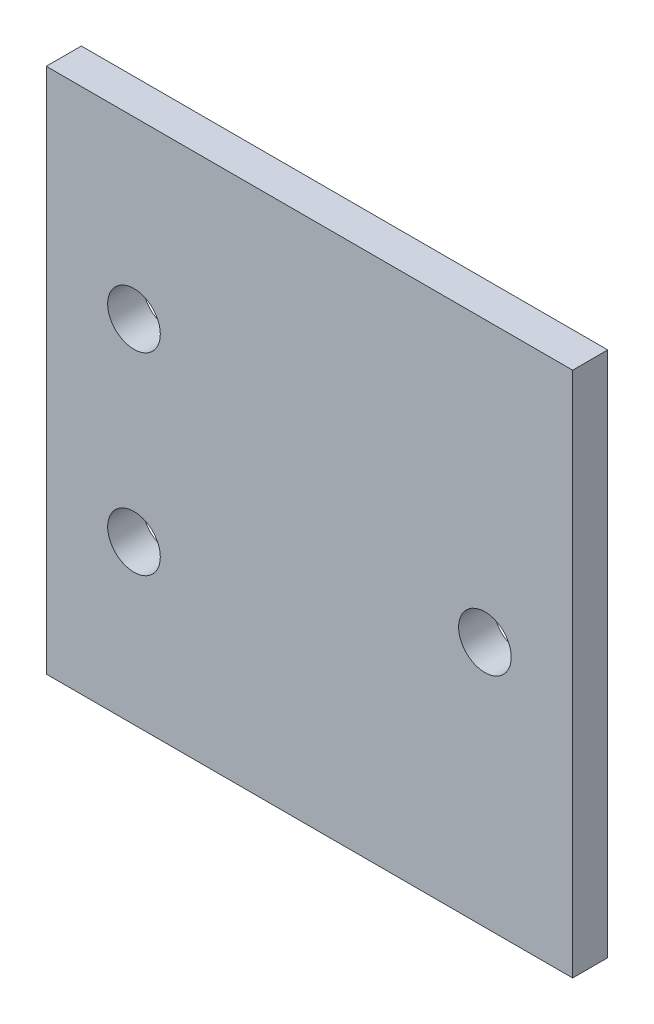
from build123d import *

# Parameters (mm, degrees)
SKETCH1_W           = 30
SKETCH1_H           = 30
SKETCH1_R           = 1.5
BOSS_EXTRUDE2_DEPTH = 2


with BuildPart() as part:
    # Sketch1 → Boss-Extrude2 (new body)
    with BuildSketch(Plane.XY):
        with Locations((15, -15)):
            Rectangle(SKETCH1_W, SKETCH1_H)
        with Locations((5, -9.972165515)):
            Circle(SKETCH1_R, mode=Mode.SUBTRACT)
        with Locations((5, -20.972165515)):
            Circle(SKETCH1_R, mode=Mode.SUBTRACT)
        with Locations((25, -15.92438295)):
            Circle(SKETCH1_R, mode=Mode.SUBTRACT)
    extrude(amount=BOSS_EXTRUDE2_DEPTH)


solid = part.part
